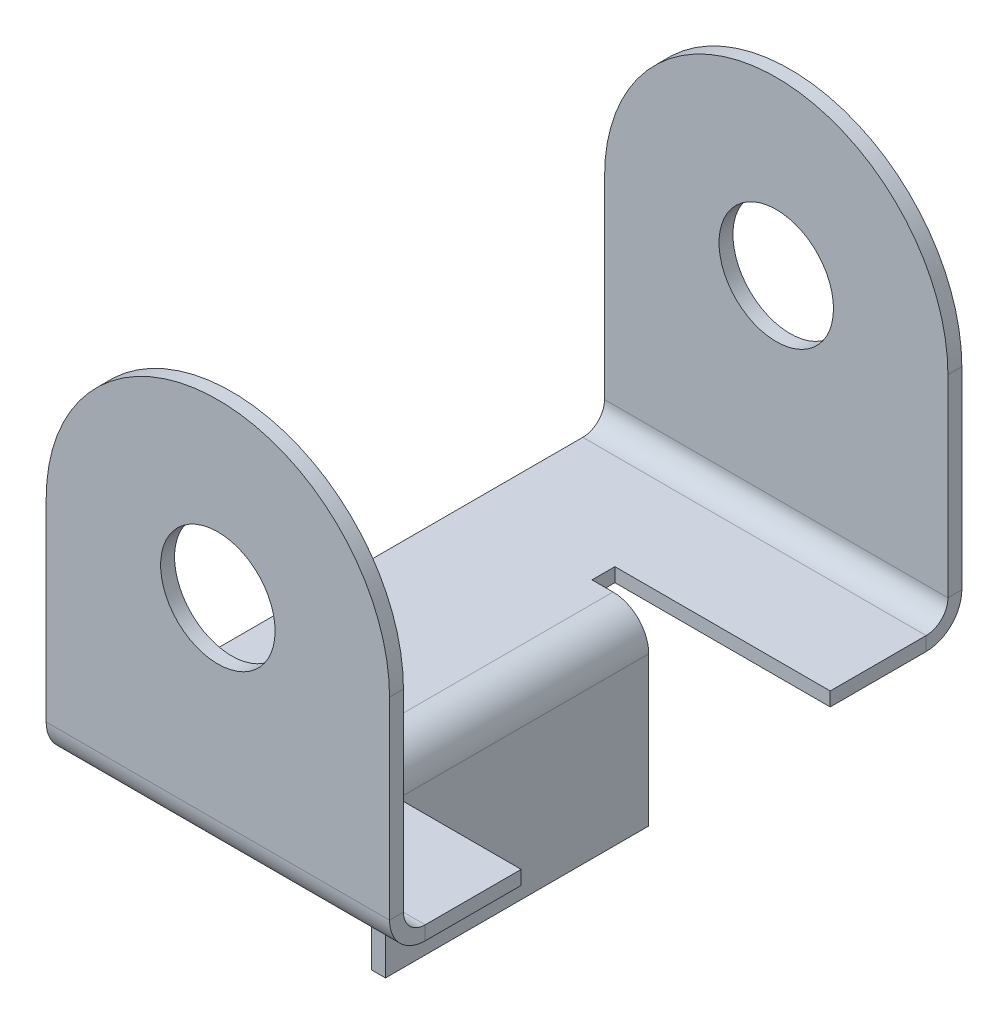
ISO-10303-21;
HEADER;
FILE_DESCRIPTION(('STEP AP214'),'2;1');
FILE_NAME('part.step','',(''),(''),'','','');
FILE_SCHEMA(('AUTOMOTIVE_DESIGN { 1 0 10303 214 1 1 1 1 }'));
ENDSEC;
DATA;
#1=APPLICATION_CONTEXT('core data for automotive mechanical design processes');
#2=APPLICATION_PROTOCOL_DEFINITION('international standard','automotive_design',2000,#1);
#3=PRODUCT_CONTEXT('',#1,'mechanical');
#4=PRODUCT('Part','Part','',(#3));
#5=PRODUCT_RELATED_PRODUCT_CATEGORY('part','',(#4));
#6=PRODUCT_DEFINITION_FORMATION('','',#4);
#7=PRODUCT_DEFINITION_CONTEXT('part definition',#1,'design');
#8=PRODUCT_DEFINITION('design','',#6,#7);
#9=PRODUCT_DEFINITION_SHAPE('','',#8);
#10=(LENGTH_UNIT() NAMED_UNIT(*) SI_UNIT(.MILLI.,.METRE.));
#11=(NAMED_UNIT(*) PLANE_ANGLE_UNIT() SI_UNIT($,.RADIAN.));
#12=(NAMED_UNIT(*) SI_UNIT($,.STERADIAN.) SOLID_ANGLE_UNIT());
#13=UNCERTAINTY_MEASURE_WITH_UNIT(LENGTH_MEASURE(1.E-05),#10,'distance_accuracy_value','');
#14=(GEOMETRIC_REPRESENTATION_CONTEXT(3) GLOBAL_UNCERTAINTY_ASSIGNED_CONTEXT((#13)) GLOBAL_UNIT_ASSIGNED_CONTEXT((#10,
#11,#12)) REPRESENTATION_CONTEXT('',''));
#15=CARTESIAN_POINT('',(0.,0.,0.));
#16=DIRECTION('',(0.,0.,1.));
#17=DIRECTION('',(1.,0.,0.));
#18=AXIS2_PLACEMENT_3D('',#15,#16,#17);
#19=CARTESIAN_POINT('',(18.81,-20.,-11.5));
#20=DIRECTION('',(0.,0.,-1.));
#21=DIRECTION('',(-1.,0.,0.));
#22=AXIS2_PLACEMENT_3D('',#19,#20,#21);
#23=PLANE('',#22);
#24=DIRECTION('',(-1.,0.,0.));
#25=VECTOR('',#24,1.);
#26=CARTESIAN_POINT('',(-15.,-18.78588,-11.5));
#27=LINE('',#26,#25);
#28=CARTESIAN_POINT('',(-3.81000000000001,-18.78588,-11.5));
#29=VERTEX_POINT('',#28);
#30=CARTESIAN_POINT('',(-1.9729673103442,-18.78588,-11.5));
#31=VERTEX_POINT('',#30);
#32=EDGE_CURVE('E216',#29,#31,#27,.F.);
#33=ORIENTED_EDGE('',*,*,#32,.T.);
#34=DIRECTION('',(0.,-1.,0.));
#35=VECTOR('',#34,1.);
#36=CARTESIAN_POINT('',(-1.97296731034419,-20.,-11.5));
#37=LINE('',#36,#35);
#38=CARTESIAN_POINT('',(-1.97296731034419,-20.,-11.5));
#39=VERTEX_POINT('',#38);
#40=EDGE_CURVE('E270',#31,#39,#37,.T.);
#41=ORIENTED_EDGE('',*,*,#40,.T.);
#42=DIRECTION('',(-1.,0.,0.));
#43=VECTOR('',#42,1.);
#44=CARTESIAN_POINT('',(18.81,-20.,-11.5));
#45=LINE('',#44,#43);
#46=CARTESIAN_POINT('',(-3.81000000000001,-20.,-11.5));
#47=VERTEX_POINT('',#46);
#48=EDGE_CURVE('E278',#47,#39,#45,.F.);
#49=ORIENTED_EDGE('',*,*,#48,.F.);
#50=DIRECTION('',(0.,-1.,0.));
#51=VECTOR('',#50,1.);
#52=CARTESIAN_POINT('',(-3.81000000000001,-20.,-11.5));
#53=LINE('',#52,#51);
#54=EDGE_CURVE('E256',#29,#47,#53,.T.);
#55=ORIENTED_EDGE('',*,*,#54,.F.);
#56=EDGE_LOOP('',(#33,#41,#49,#55));
#57=FACE_BOUND('',#56,.T.);
#58=ADVANCED_FACE('F40',(#57),#23,.T.);
#59=CARTESIAN_POINT('',(18.81,-20.,11.5));
#60=DIRECTION('',(0.,0.,-1.));
#61=DIRECTION('',(-1.,0.,0.));
#62=AXIS2_PLACEMENT_3D('',#59,#60,#61);
#63=PLANE('',#62);
#64=DIRECTION('',(-1.,0.,0.));
#65=VECTOR('',#64,1.);
#66=CARTESIAN_POINT('',(18.81,-20.,11.5));
#67=LINE('',#66,#65);
#68=CARTESIAN_POINT('',(-1.97296731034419,-20.,11.5));
#69=VERTEX_POINT('',#68);
#70=CARTESIAN_POINT('',(-3.81000000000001,-20.,11.5));
#71=VERTEX_POINT('',#70);
#72=EDGE_CURVE('E281',#69,#71,#67,.T.);
#73=ORIENTED_EDGE('',*,*,#72,.F.);
#74=DIRECTION('',(0.,1.,0.));
#75=VECTOR('',#74,1.);
#76=CARTESIAN_POINT('',(-1.97296731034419,-20.,11.5));
#77=LINE('',#76,#75);
#78=CARTESIAN_POINT('',(-1.97296731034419,-18.78588,11.5));
#79=VERTEX_POINT('',#78);
#80=EDGE_CURVE('E12',#69,#79,#77,.T.);
#81=ORIENTED_EDGE('',*,*,#80,.T.);
#82=DIRECTION('',(-1.,0.,0.));
#83=VECTOR('',#82,1.);
#84=CARTESIAN_POINT('',(-15.,-18.78588,11.5));
#85=LINE('',#84,#83);
#86=CARTESIAN_POINT('',(-3.81000000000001,-18.78588,11.5));
#87=VERTEX_POINT('',#86);
#88=EDGE_CURVE('E211',#79,#87,#85,.T.);
#89=ORIENTED_EDGE('',*,*,#88,.T.);
#90=DIRECTION('',(0.,-1.,0.));
#91=VECTOR('',#90,1.);
#92=CARTESIAN_POINT('',(-3.81000000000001,-20.,11.5));
#93=LINE('',#92,#91);
#94=EDGE_CURVE('E253',#87,#71,#93,.T.);
#95=ORIENTED_EDGE('',*,*,#94,.T.);
#96=EDGE_LOOP('',(#73,#81,#89,#95));
#97=FACE_BOUND('',#96,.T.);
#98=ADVANCED_FACE('F42',(#97),#63,.F.);
#99=CARTESIAN_POINT('',(-15.,-18.78588,25.));
#100=DIRECTION('',(0.,1.,0.));
#101=DIRECTION('',(-1.,0.,0.));
#102=AXIS2_PLACEMENT_3D('',#99,#100,#101);
#103=PLANE('',#102);
#104=ORIENTED_EDGE('',*,*,#88,.F.);
#105=DIRECTION('',(0.,0.,-1.));
#106=VECTOR('',#105,1.);
#107=CARTESIAN_POINT('',(-1.97296731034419,-18.78588,25.));
#108=LINE('',#107,#106);
#109=EDGE_CURVE('E49',#79,#31,#108,.T.);
#110=ORIENTED_EDGE('',*,*,#109,.T.);
#111=ORIENTED_EDGE('',*,*,#32,.F.);
#112=DIRECTION('',(0.,0.,1.));
#113=VECTOR('',#112,1.);
#114=CARTESIAN_POINT('',(-3.81000000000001,-18.78588,25.));
#115=LINE('',#114,#113);
#116=CARTESIAN_POINT('',(-3.81000000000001,-18.78588,-13.5));
#117=VERTEX_POINT('',#116);
#118=EDGE_CURVE('E212',#117,#29,#115,.T.);
#119=ORIENTED_EDGE('',*,*,#118,.F.);
#120=DIRECTION('',(-1.,0.,0.));
#121=VECTOR('',#120,1.);
#122=CARTESIAN_POINT('',(-15.,-18.78588,-13.5));
#123=LINE('',#122,#121);
#124=CARTESIAN_POINT('',(15.,-18.78588,-13.5));
#125=VERTEX_POINT('',#124);
#126=EDGE_CURVE('E215',#125,#117,#123,.T.);
#127=ORIENTED_EDGE('',*,*,#126,.F.);
#128=DIRECTION('',(0.,0.,1.));
#129=VECTOR('',#128,1.);
#130=CARTESIAN_POINT('',(15.,-18.78588,25.));
#131=LINE('',#130,#129);
#132=CARTESIAN_POINT('',(15.,-18.78588,-21.88088));
#133=VERTEX_POINT('',#132);
#134=EDGE_CURVE('E200',#125,#133,#131,.F.);
#135=ORIENTED_EDGE('',*,*,#134,.T.);
#136=DIRECTION('',(-1.,0.,0.));
#137=VECTOR('',#136,1.);
#138=CARTESIAN_POINT('',(-15.,-18.78588,-21.88088));
#139=LINE('',#138,#137);
#140=CARTESIAN_POINT('',(-15.,-18.78588,-21.88088));
#141=VERTEX_POINT('',#140);
#142=EDGE_CURVE('E162',#141,#133,#139,.F.);
#143=ORIENTED_EDGE('',*,*,#142,.F.);
#144=DIRECTION('',(0.,0.,1.));
#145=VECTOR('',#144,1.);
#146=CARTESIAN_POINT('',(-15.,-18.78588,25.));
#147=LINE('',#146,#145);
#148=CARTESIAN_POINT('',(-15.,-18.78588,21.88088));
#149=VERTEX_POINT('',#148);
#150=EDGE_CURVE('E184',#149,#141,#147,.F.);
#151=ORIENTED_EDGE('',*,*,#150,.F.);
#152=DIRECTION('',(-1.,0.,0.));
#153=VECTOR('',#152,1.);
#154=CARTESIAN_POINT('',(-15.,-18.78588,21.88088));
#155=LINE('',#154,#153);
#156=CARTESIAN_POINT('',(15.,-18.78588,21.88088));
#157=VERTEX_POINT('',#156);
#158=EDGE_CURVE('E324',#157,#149,#155,.T.);
#159=ORIENTED_EDGE('',*,*,#158,.F.);
#160=DIRECTION('',(0.,0.,1.));
#161=VECTOR('',#160,1.);
#162=CARTESIAN_POINT('',(15.,-18.78588,25.));
#163=LINE('',#162,#161);
#164=CARTESIAN_POINT('',(15.,-18.78588,13.5));
#165=VERTEX_POINT('',#164);
#166=EDGE_CURVE('E187',#157,#165,#163,.F.);
#167=ORIENTED_EDGE('',*,*,#166,.T.);
#168=DIRECTION('',(-1.,0.,0.));
#169=VECTOR('',#168,1.);
#170=CARTESIAN_POINT('',(-15.,-18.78588,13.5));
#171=LINE('',#170,#169);
#172=CARTESIAN_POINT('',(-3.81000000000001,-18.78588,13.5));
#173=VERTEX_POINT('',#172);
#174=EDGE_CURVE('E175',#173,#165,#171,.F.);
#175=ORIENTED_EDGE('',*,*,#174,.F.);
#176=DIRECTION('',(0.,0.,1.));
#177=VECTOR('',#176,1.);
#178=CARTESIAN_POINT('',(-3.81000000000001,-18.78588,25.));
#179=LINE('',#178,#177);
#180=EDGE_CURVE('E208',#87,#173,#179,.T.);
#181=ORIENTED_EDGE('',*,*,#180,.F.);
#182=EDGE_LOOP('',(#104,#110,#111,#119,#127,#135,#143,#151,#159,#167,#175,#181));
#183=FACE_BOUND('',#182,.T.);
#184=ADVANCED_FACE('F349',(#183),#103,.T.);
#185=CARTESIAN_POINT('',(15.,-20.,25.));
#186=DIRECTION('',(1.,0.,0.));
#187=DIRECTION('',(0.,0.,-1.));
#188=AXIS2_PLACEMENT_3D('',#185,#186,#187);
#189=PLANE('',#188);
#190=DIRECTION('',(0.,-1.,0.));
#191=VECTOR('',#190,1.);
#192=CARTESIAN_POINT('',(15.,-20.,-21.88088));
#193=LINE('',#192,#191);
#194=CARTESIAN_POINT('',(15.,-20.,-21.88088));
#195=VERTEX_POINT('',#194);
#196=EDGE_CURVE('E265',#133,#195,#193,.T.);
#197=ORIENTED_EDGE('',*,*,#196,.F.);
#198=ORIENTED_EDGE('',*,*,#134,.F.);
#199=DIRECTION('',(0.,-1.,0.));
#200=VECTOR('',#199,1.);
#201=CARTESIAN_POINT('',(15.,-20.,-13.5));
#202=LINE('',#201,#200);
#203=CARTESIAN_POINT('',(15.,-20.,-13.5));
#204=VERTEX_POINT('',#203);
#205=EDGE_CURVE('E262',#125,#204,#202,.T.);
#206=ORIENTED_EDGE('',*,*,#205,.T.);
#207=DIRECTION('',(0.,0.,-1.));
#208=VECTOR('',#207,1.);
#209=CARTESIAN_POINT('',(15.,-20.,25.));
#210=LINE('',#209,#208);
#211=EDGE_CURVE('E372',#204,#195,#210,.T.);
#212=ORIENTED_EDGE('',*,*,#211,.T.);
#213=EDGE_LOOP('',(#197,#198,#206,#212));
#214=FACE_BOUND('',#213,.T.);
#215=ADVANCED_FACE('F531',(#214),#189,.T.);
#216=CARTESIAN_POINT('',(18.81,-20.,-13.5));
#217=DIRECTION('',(0.,0.,-1.));
#218=DIRECTION('',(-1.,0.,0.));
#219=AXIS2_PLACEMENT_3D('',#216,#217,#218);
#220=PLANE('',#219);
#221=ORIENTED_EDGE('',*,*,#205,.F.);
#222=ORIENTED_EDGE('',*,*,#126,.T.);
#223=DIRECTION('',(0.,-1.,0.));
#224=VECTOR('',#223,1.);
#225=CARTESIAN_POINT('',(-3.81000000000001,-20.,-13.5));
#226=LINE('',#225,#224);
#227=CARTESIAN_POINT('',(-3.81000000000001,-20.,-13.5));
#228=VERTEX_POINT('',#227);
#229=EDGE_CURVE('E259',#117,#228,#226,.T.);
#230=ORIENTED_EDGE('',*,*,#229,.T.);
#231=DIRECTION('',(-1.,0.,0.));
#232=VECTOR('',#231,1.);
#233=CARTESIAN_POINT('',(18.81,-20.,-13.5));
#234=LINE('',#233,#232);
#235=EDGE_CURVE('E301',#204,#228,#234,.T.);
#236=ORIENTED_EDGE('',*,*,#235,.F.);
#237=EDGE_LOOP('',(#221,#222,#230,#236));
#238=FACE_BOUND('',#237,.T.);
#239=ADVANCED_FACE('F535',(#238),#220,.F.);
#240=CARTESIAN_POINT('',(-3.81000000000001,-20.,25.));
#241=DIRECTION('',(-1.,0.,0.));
#242=DIRECTION('',(0.,0.,1.));
#243=AXIS2_PLACEMENT_3D('',#240,#241,#242);
#244=PLANE('',#243);
#245=ORIENTED_EDGE('',*,*,#229,.F.);
#246=ORIENTED_EDGE('',*,*,#118,.T.);
#247=ORIENTED_EDGE('',*,*,#54,.T.);
#248=DIRECTION('',(0.,0.,1.));
#249=VECTOR('',#248,1.);
#250=CARTESIAN_POINT('',(-3.81000000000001,-20.,25.));
#251=LINE('',#250,#249);
#252=EDGE_CURVE('E280',#228,#47,#251,.T.);
#253=ORIENTED_EDGE('',*,*,#252,.F.);
#254=EDGE_LOOP('',(#245,#246,#247,#253));
#255=FACE_BOUND('',#254,.T.);
#256=ADVANCED_FACE('F541',(#255),#244,.F.);
#257=CARTESIAN_POINT('',(-3.81000000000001,-20.,25.));
#258=DIRECTION('',(-1.,0.,0.));
#259=DIRECTION('',(0.,0.,1.));
#260=AXIS2_PLACEMENT_3D('',#257,#258,#259);
#261=PLANE('',#260);
#262=ORIENTED_EDGE('',*,*,#94,.F.);
#263=ORIENTED_EDGE('',*,*,#180,.T.);
#264=DIRECTION('',(0.,-1.,0.));
#265=VECTOR('',#264,1.);
#266=CARTESIAN_POINT('',(-3.81000000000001,-20.,13.5));
#267=LINE('',#266,#265);
#268=CARTESIAN_POINT('',(-3.81000000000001,-20.,13.5));
#269=VERTEX_POINT('',#268);
#270=EDGE_CURVE('E250',#173,#269,#267,.T.);
#271=ORIENTED_EDGE('',*,*,#270,.T.);
#272=DIRECTION('',(0.,0.,1.));
#273=VECTOR('',#272,1.);
#274=CARTESIAN_POINT('',(-3.81000000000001,-20.,25.));
#275=LINE('',#274,#273);
#276=EDGE_CURVE('E283',#71,#269,#275,.T.);
#277=ORIENTED_EDGE('',*,*,#276,.F.);
#278=EDGE_LOOP('',(#262,#263,#271,#277));
#279=FACE_BOUND('',#278,.T.);
#280=ADVANCED_FACE('F553',(#279),#261,.F.);
#281=CARTESIAN_POINT('',(18.81,-20.,13.5));
#282=DIRECTION('',(0.,0.,-1.));
#283=DIRECTION('',(-1.,0.,0.));
#284=AXIS2_PLACEMENT_3D('',#281,#282,#283);
#285=PLANE('',#284);
#286=ORIENTED_EDGE('',*,*,#270,.F.);
#287=ORIENTED_EDGE('',*,*,#174,.T.);
#288=DIRECTION('',(0.,-1.,0.));
#289=VECTOR('',#288,1.);
#290=CARTESIAN_POINT('',(15.,-20.,13.5));
#291=LINE('',#290,#289);
#292=CARTESIAN_POINT('',(15.,-20.,13.5));
#293=VERTEX_POINT('',#292);
#294=EDGE_CURVE('E247',#165,#293,#291,.T.);
#295=ORIENTED_EDGE('',*,*,#294,.T.);
#296=DIRECTION('',(-1.,0.,0.));
#297=VECTOR('',#296,1.);
#298=CARTESIAN_POINT('',(18.81,-20.,13.5));
#299=LINE('',#298,#297);
#300=EDGE_CURVE('E289',#269,#293,#299,.F.);
#301=ORIENTED_EDGE('',*,*,#300,.F.);
#302=EDGE_LOOP('',(#286,#287,#295,#301));
#303=FACE_BOUND('',#302,.T.);
#304=ADVANCED_FACE('F546',(#303),#285,.T.);
#305=ORIENTED_EDGE('',*,*,#294,.F.);
#306=ORIENTED_EDGE('',*,*,#166,.F.);
#307=DIRECTION('',(0.,-1.,0.));
#308=VECTOR('',#307,1.);
#309=CARTESIAN_POINT('',(15.,-20.,21.88088));
#310=LINE('',#309,#308);
#311=CARTESIAN_POINT('',(15.,-20.,21.88088));
#312=VERTEX_POINT('',#311);
#313=EDGE_CURVE('E66',#157,#312,#310,.T.);
#314=ORIENTED_EDGE('',*,*,#313,.T.);
#315=EDGE_CURVE('E44',#312,#293,#210,.T.);
#316=ORIENTED_EDGE('',*,*,#315,.T.);
#317=EDGE_LOOP('',(#305,#306,#314,#316));
#318=FACE_BOUND('',#317,.T.);
#319=ADVANCED_FACE('F537',(#318),#189,.T.);
#320=CARTESIAN_POINT('',(15.,-16.88088,21.88088));
#321=DIRECTION('',(1.,0.,0.));
#322=DIRECTION('',(0.,1.,0.));
#323=AXIS2_PLACEMENT_3D('',#320,#321,#322);
#324=PLANE('',#323);
#325=ORIENTED_EDGE('',*,*,#313,.F.);
#326=CARTESIAN_POINT('',(15.,-16.88088,21.88088));
#327=DIRECTION('',(-1.,0.,0.));
#328=DIRECTION('',(0.,-1.,0.));
#329=AXIS2_PLACEMENT_3D('',#326,#327,#328);
#330=CIRCLE('',#329,1.905);
#331=CARTESIAN_POINT('',(15.,-16.88088,23.78588));
#332=VERTEX_POINT('',#331);
#333=EDGE_CURVE('E190',#157,#332,#330,.T.);
#334=ORIENTED_EDGE('',*,*,#333,.T.);
#335=DIRECTION('',(0.,0.,1.));
#336=VECTOR('',#335,1.);
#337=CARTESIAN_POINT('',(15.,-16.88088,25.));
#338=LINE('',#337,#336);
#339=CARTESIAN_POINT('',(15.,-16.88088,25.));
#340=VERTEX_POINT('',#339);
#341=EDGE_CURVE('E243',#332,#340,#338,.T.);
#342=ORIENTED_EDGE('',*,*,#341,.T.);
#343=CARTESIAN_POINT('',(15.,-16.88088,21.88088));
#344=DIRECTION('',(-1.,0.,0.));
#345=DIRECTION('',(0.,-1.,0.));
#346=AXIS2_PLACEMENT_3D('',#343,#344,#345);
#347=CIRCLE('',#346,3.11912);
#348=EDGE_CURVE('E321',#312,#340,#347,.T.);
#349=ORIENTED_EDGE('',*,*,#348,.F.);
#350=EDGE_LOOP('',(#325,#334,#342,#349));
#351=FACE_BOUND('',#350,.T.);
#352=ADVANCED_FACE('F342',(#351),#324,.T.);
#353=CARTESIAN_POINT('',(15.,0.,25.));
#354=DIRECTION('',(1.,0.,0.));
#355=DIRECTION('',(0.,1.,0.));
#356=AXIS2_PLACEMENT_3D('',#353,#354,#355);
#357=PLANE('',#356);
#358=ORIENTED_EDGE('',*,*,#341,.F.);
#359=DIRECTION('',(0.,1.,0.));
#360=VECTOR('',#359,1.);
#361=CARTESIAN_POINT('',(15.,0.,23.78588));
#362=LINE('',#361,#360);
#363=CARTESIAN_POINT('',(15.,0.,23.78588));
#364=VERTEX_POINT('',#363);
#365=EDGE_CURVE('E194',#332,#364,#362,.T.);
#366=ORIENTED_EDGE('',*,*,#365,.T.);
#367=DIRECTION('',(0.,0.,1.));
#368=VECTOR('',#367,1.);
#369=CARTESIAN_POINT('',(15.,0.,25.));
#370=LINE('',#369,#368);
#371=CARTESIAN_POINT('',(15.,0.,25.));
#372=VERTEX_POINT('',#371);
#373=EDGE_CURVE('E240',#364,#372,#370,.T.);
#374=ORIENTED_EDGE('',*,*,#373,.T.);
#375=DIRECTION('',(0.,1.,0.));
#376=VECTOR('',#375,1.);
#377=CARTESIAN_POINT('',(15.,0.,25.));
#378=LINE('',#377,#376);
#379=EDGE_CURVE('E370',#340,#372,#378,.T.);
#380=ORIENTED_EDGE('',*,*,#379,.F.);
#381=EDGE_LOOP('',(#358,#366,#374,#380));
#382=FACE_BOUND('',#381,.T.);
#383=ADVANCED_FACE('F551',(#382),#357,.T.);
#384=CARTESIAN_POINT('',(0.,0.,25.));
#385=DIRECTION('',(0.,0.,1.));
#386=DIRECTION('',(1.,0.,0.));
#387=AXIS2_PLACEMENT_3D('',#384,#385,#386);
#388=CYLINDRICAL_SURFACE('',#387,15.);
#389=ORIENTED_EDGE('',*,*,#373,.F.);
#390=CARTESIAN_POINT('',(0.,0.,23.78588));
#391=DIRECTION('',(0.,0.,1.));
#392=DIRECTION('',(1.,0.,0.));
#393=AXIS2_PLACEMENT_3D('',#390,#391,#392);
#394=CIRCLE('',#393,15.);
#395=CARTESIAN_POINT('',(-15.,0.,23.78588));
#396=VERTEX_POINT('',#395);
#397=EDGE_CURVE('E195',#364,#396,#394,.T.);
#398=ORIENTED_EDGE('',*,*,#397,.T.);
#399=DIRECTION('',(0.,0.,1.));
#400=VECTOR('',#399,1.);
#401=CARTESIAN_POINT('',(-15.,0.,25.));
#402=LINE('',#401,#400);
#403=CARTESIAN_POINT('',(-15.,0.,25.));
#404=VERTEX_POINT('',#403);
#405=EDGE_CURVE('E237',#396,#404,#402,.T.);
#406=ORIENTED_EDGE('',*,*,#405,.T.);
#407=CARTESIAN_POINT('',(0.,0.,25.));
#408=DIRECTION('',(0.,0.,1.));
#409=DIRECTION('',(1.,0.,0.));
#410=AXIS2_PLACEMENT_3D('',#407,#408,#409);
#411=CIRCLE('',#410,15.);
#412=EDGE_CURVE('E369',#372,#404,#411,.T.);
#413=ORIENTED_EDGE('',*,*,#412,.F.);
#414=EDGE_LOOP('',(#389,#398,#406,#413));
#415=FACE_BOUND('',#414,.T.);
#416=ADVANCED_FACE('F575',(#415),#388,.T.);
#417=CARTESIAN_POINT('',(-15.,0.,25.));
#418=DIRECTION('',(-1.,0.,0.));
#419=DIRECTION('',(0.,-1.,0.));
#420=AXIS2_PLACEMENT_3D('',#417,#418,#419);
#421=PLANE('',#420);
#422=ORIENTED_EDGE('',*,*,#405,.F.);
#423=DIRECTION('',(0.,1.,0.));
#424=VECTOR('',#423,1.);
#425=CARTESIAN_POINT('',(-15.,0.,23.78588));
#426=LINE('',#425,#424);
#427=CARTESIAN_POINT('',(-15.,-16.88088,23.78588));
#428=VERTEX_POINT('',#427);
#429=EDGE_CURVE('E191',#396,#428,#426,.F.);
#430=ORIENTED_EDGE('',*,*,#429,.T.);
#431=DIRECTION('',(0.,0.,1.));
#432=VECTOR('',#431,1.);
#433=CARTESIAN_POINT('',(-15.,-16.88088,25.));
#434=LINE('',#433,#432);
#435=CARTESIAN_POINT('',(-15.,-16.88088,25.));
#436=VERTEX_POINT('',#435);
#437=EDGE_CURVE('E234',#428,#436,#434,.T.);
#438=ORIENTED_EDGE('',*,*,#437,.T.);
#439=DIRECTION('',(0.,-1.,0.));
#440=VECTOR('',#439,1.);
#441=CARTESIAN_POINT('',(-15.,0.,25.));
#442=LINE('',#441,#440);
#443=EDGE_CURVE('E361',#404,#436,#442,.T.);
#444=ORIENTED_EDGE('',*,*,#443,.F.);
#445=EDGE_LOOP('',(#422,#430,#438,#444));
#446=FACE_BOUND('',#445,.T.);
#447=ADVANCED_FACE('F360',(#446),#421,.T.);
#448=CARTESIAN_POINT('',(-15.,-16.88088,21.88088));
#449=DIRECTION('',(1.,0.,0.));
#450=DIRECTION('',(0.,1.,0.));
#451=AXIS2_PLACEMENT_3D('',#448,#449,#450);
#452=PLANE('',#451);
#453=ORIENTED_EDGE('',*,*,#437,.F.);
#454=CARTESIAN_POINT('',(-15.,-16.88088,21.88088));
#455=DIRECTION('',(-1.,0.,0.));
#456=DIRECTION('',(0.,-1.,0.));
#457=AXIS2_PLACEMENT_3D('',#454,#455,#456);
#458=CIRCLE('',#457,1.905);
#459=EDGE_CURVE('E169',#428,#149,#458,.F.);
#460=ORIENTED_EDGE('',*,*,#459,.T.);
#461=DIRECTION('',(0.,-1.,0.));
#462=VECTOR('',#461,1.);
#463=CARTESIAN_POINT('',(-15.,-20.,21.88088));
#464=LINE('',#463,#462);
#465=CARTESIAN_POINT('',(-15.,-20.,21.88088));
#466=VERTEX_POINT('',#465);
#467=EDGE_CURVE('E232',#149,#466,#464,.T.);
#468=ORIENTED_EDGE('',*,*,#467,.T.);
#469=CARTESIAN_POINT('',(-15.,-16.88088,21.88088));
#470=DIRECTION('',(-1.,0.,0.));
#471=DIRECTION('',(0.,-1.,0.));
#472=AXIS2_PLACEMENT_3D('',#469,#470,#471);
#473=CIRCLE('',#472,3.11912);
#474=EDGE_CURVE('E313',#436,#466,#473,.F.);
#475=ORIENTED_EDGE('',*,*,#474,.F.);
#476=EDGE_LOOP('',(#453,#460,#468,#475));
#477=FACE_BOUND('',#476,.T.);
#478=ADVANCED_FACE('F353',(#477),#452,.F.);
#479=CARTESIAN_POINT('',(-15.,-20.,25.));
#480=DIRECTION('',(1.,0.,0.));
#481=DIRECTION('',(0.,0.,-1.));
#482=AXIS2_PLACEMENT_3D('',#479,#480,#481);
#483=PLANE('',#482);
#484=ORIENTED_EDGE('',*,*,#467,.F.);
#485=ORIENTED_EDGE('',*,*,#150,.T.);
#486=DIRECTION('',(0.,-1.,0.));
#487=VECTOR('',#486,1.);
#488=CARTESIAN_POINT('',(-15.,-20.,-21.88088));
#489=LINE('',#488,#487);
#490=CARTESIAN_POINT('',(-15.,-20.,-21.88088));
#491=VERTEX_POINT('',#490);
#492=EDGE_CURVE('E229',#141,#491,#489,.T.);
#493=ORIENTED_EDGE('',*,*,#492,.T.);
#494=DIRECTION('',(0.,0.,-1.));
#495=VECTOR('',#494,1.);
#496=CARTESIAN_POINT('',(-15.,-20.,25.));
#497=LINE('',#496,#495);
#498=EDGE_CURVE('E377',#466,#491,#497,.T.);
#499=ORIENTED_EDGE('',*,*,#498,.F.);
#500=EDGE_LOOP('',(#484,#485,#493,#499));
#501=FACE_BOUND('',#500,.T.);
#502=ADVANCED_FACE('F562',(#501),#483,.F.);
#503=CARTESIAN_POINT('',(-15.,-16.88088,-21.88088));
#504=DIRECTION('',(-1.,0.,0.));
#505=DIRECTION('',(0.,-1.,0.));
#506=AXIS2_PLACEMENT_3D('',#503,#504,#505);
#507=PLANE('',#506);
#508=ORIENTED_EDGE('',*,*,#492,.F.);
#509=CARTESIAN_POINT('',(-15.,-16.88088,-21.88088));
#510=DIRECTION('',(1.,0.,0.));
#511=DIRECTION('',(0.,1.,0.));
#512=AXIS2_PLACEMENT_3D('',#509,#510,#511);
#513=CIRCLE('',#512,1.905);
#514=CARTESIAN_POINT('',(-15.,-16.88088,-23.78588));
#515=VERTEX_POINT('',#514);
#516=EDGE_CURVE('E168',#141,#515,#513,.T.);
#517=ORIENTED_EDGE('',*,*,#516,.T.);
#518=DIRECTION('',(0.,0.,-1.));
#519=VECTOR('',#518,1.);
#520=CARTESIAN_POINT('',(-15.,-16.88088,-25.));
#521=LINE('',#520,#519);
#522=CARTESIAN_POINT('',(-15.,-16.88088,-25.));
#523=VERTEX_POINT('',#522);
#524=EDGE_CURVE('E226',#515,#523,#521,.T.);
#525=ORIENTED_EDGE('',*,*,#524,.T.);
#526=CARTESIAN_POINT('',(-15.,-16.88088,-21.88088));
#527=DIRECTION('',(1.,0.,0.));
#528=DIRECTION('',(0.,1.,0.));
#529=AXIS2_PLACEMENT_3D('',#526,#527,#528);
#530=CIRCLE('',#529,3.11912);
#531=EDGE_CURVE('E312',#491,#523,#530,.T.);
#532=ORIENTED_EDGE('',*,*,#531,.F.);
#533=EDGE_LOOP('',(#508,#517,#525,#532));
#534=FACE_BOUND('',#533,.T.);
#535=ADVANCED_FACE('F561',(#534),#507,.T.);
#536=CARTESIAN_POINT('',(-15.,0.,-25.));
#537=DIRECTION('',(-1.,0.,0.));
#538=DIRECTION('',(0.,-1.,0.));
#539=AXIS2_PLACEMENT_3D('',#536,#537,#538);
#540=PLANE('',#539);
#541=ORIENTED_EDGE('',*,*,#524,.F.);
#542=DIRECTION('',(0.,1.,0.));
#543=VECTOR('',#542,1.);
#544=CARTESIAN_POINT('',(-15.,0.,-23.78588));
#545=LINE('',#544,#543);
#546=CARTESIAN_POINT('',(-15.,0.,-23.78588));
#547=VERTEX_POINT('',#546);
#548=EDGE_CURVE('E157',#547,#515,#545,.F.);
#549=ORIENTED_EDGE('',*,*,#548,.F.);
#550=DIRECTION('',(0.,0.,-1.));
#551=VECTOR('',#550,1.);
#552=CARTESIAN_POINT('',(-15.,0.,-25.));
#553=LINE('',#552,#551);
#554=CARTESIAN_POINT('',(-15.,0.,-25.));
#555=VERTEX_POINT('',#554);
#556=EDGE_CURVE('E223',#547,#555,#553,.T.);
#557=ORIENTED_EDGE('',*,*,#556,.T.);
#558=DIRECTION('',(0.,-1.,0.));
#559=VECTOR('',#558,1.);
#560=CARTESIAN_POINT('',(-15.,0.,-25.));
#561=LINE('',#560,#559);
#562=EDGE_CURVE('E295',#555,#523,#561,.T.);
#563=ORIENTED_EDGE('',*,*,#562,.T.);
#564=EDGE_LOOP('',(#541,#549,#557,#563));
#565=FACE_BOUND('',#564,.T.);
#566=ADVANCED_FACE('F390',(#565),#540,.T.);
#567=CARTESIAN_POINT('',(0.,0.,-25.));
#568=DIRECTION('',(0.,0.,1.));
#569=DIRECTION('',(1.,0.,0.));
#570=AXIS2_PLACEMENT_3D('',#567,#568,#569);
#571=CYLINDRICAL_SURFACE('',#570,15.);
#572=ORIENTED_EDGE('',*,*,#556,.F.);
#573=CARTESIAN_POINT('',(0.,0.,-23.78588));
#574=DIRECTION('',(0.,0.,1.));
#575=DIRECTION('',(1.,0.,0.));
#576=AXIS2_PLACEMENT_3D('',#573,#574,#575);
#577=CIRCLE('',#576,15.);
#578=CARTESIAN_POINT('',(15.,0.,-23.78588));
#579=VERTEX_POINT('',#578);
#580=EDGE_CURVE('E173',#579,#547,#577,.T.);
#581=ORIENTED_EDGE('',*,*,#580,.F.);
#582=DIRECTION('',(0.,0.,-1.));
#583=VECTOR('',#582,1.);
#584=CARTESIAN_POINT('',(15.,0.,-25.));
#585=LINE('',#584,#583);
#586=CARTESIAN_POINT('',(15.,0.,-25.));
#587=VERTEX_POINT('',#586);
#588=EDGE_CURVE('E144',#579,#587,#585,.T.);
#589=ORIENTED_EDGE('',*,*,#588,.T.);
#590=CARTESIAN_POINT('',(0.,0.,-25.));
#591=DIRECTION('',(0.,0.,1.));
#592=DIRECTION('',(1.,0.,0.));
#593=AXIS2_PLACEMENT_3D('',#590,#591,#592);
#594=CIRCLE('',#593,15.);
#595=EDGE_CURVE('E383',#587,#555,#594,.T.);
#596=ORIENTED_EDGE('',*,*,#595,.T.);
#597=EDGE_LOOP('',(#572,#581,#589,#596));
#598=FACE_BOUND('',#597,.T.);
#599=ADVANCED_FACE('F596',(#598),#571,.T.);
#600=CARTESIAN_POINT('',(15.,0.,-25.));
#601=DIRECTION('',(1.,0.,0.));
#602=DIRECTION('',(0.,1.,0.));
#603=AXIS2_PLACEMENT_3D('',#600,#601,#602);
#604=PLANE('',#603);
#605=ORIENTED_EDGE('',*,*,#588,.F.);
#606=DIRECTION('',(0.,1.,0.));
#607=VECTOR('',#606,1.);
#608=CARTESIAN_POINT('',(15.,0.,-23.78588));
#609=LINE('',#608,#607);
#610=CARTESIAN_POINT('',(15.,-16.88088,-23.78588));
#611=VERTEX_POINT('',#610);
#612=EDGE_CURVE('E154',#611,#579,#609,.T.);
#613=ORIENTED_EDGE('',*,*,#612,.F.);
#614=DIRECTION('',(0.,0.,-1.));
#615=VECTOR('',#614,1.);
#616=CARTESIAN_POINT('',(15.,-16.88088,-25.));
#617=LINE('',#616,#615);
#618=CARTESIAN_POINT('',(15.,-16.88088,-25.));
#619=VERTEX_POINT('',#618);
#620=EDGE_CURVE('E130',#611,#619,#617,.T.);
#621=ORIENTED_EDGE('',*,*,#620,.T.);
#622=DIRECTION('',(0.,1.,0.));
#623=VECTOR('',#622,1.);
#624=CARTESIAN_POINT('',(15.,0.,-25.));
#625=LINE('',#624,#623);
#626=EDGE_CURVE('E386',#619,#587,#625,.T.);
#627=ORIENTED_EDGE('',*,*,#626,.T.);
#628=EDGE_LOOP('',(#605,#613,#621,#627));
#629=FACE_BOUND('',#628,.T.);
#630=ADVANCED_FACE('F171',(#629),#604,.T.);
#631=CARTESIAN_POINT('',(0.,0.,25.));
#632=DIRECTION('',(0.,0.,1.));
#633=DIRECTION('',(1.,0.,0.));
#634=AXIS2_PLACEMENT_3D('',#631,#632,#633);
#635=CYLINDRICAL_SURFACE('',#634,5.);
#636=CARTESIAN_POINT('',(0.,0.,25.));
#637=DIRECTION('',(0.,0.,1.));
#638=DIRECTION('',(1.,0.,0.));
#639=AXIS2_PLACEMENT_3D('',#636,#637,#638);
#640=CIRCLE('',#639,5.);
#641=CARTESIAN_POINT('',(5.,0.,25.));
#642=VERTEX_POINT('',#641);
#643=EDGE_CURVE('E316',#642,#642,#640,.T.);
#644=ORIENTED_EDGE('',*,*,#643,.T.);
#645=EDGE_LOOP('',(#644));
#646=FACE_BOUND('',#645,.T.);
#647=CARTESIAN_POINT('',(0.,0.,23.78588));
#648=DIRECTION('',(0.,0.,1.));
#649=DIRECTION('',(1.,0.,0.));
#650=AXIS2_PLACEMENT_3D('',#647,#648,#649);
#651=CIRCLE('',#650,5.);
#652=CARTESIAN_POINT('',(5.,0.,23.78588));
#653=VERTEX_POINT('',#652);
#654=EDGE_CURVE('E183',#653,#653,#651,.T.);
#655=ORIENTED_EDGE('',*,*,#654,.F.);
#656=EDGE_LOOP('',(#655));
#657=FACE_BOUND('',#656,.T.);
#658=ADVANCED_FACE('F507',(#646,#657),#635,.F.);
#659=CARTESIAN_POINT('',(0.,0.,-25.));
#660=DIRECTION('',(0.,0.,1.));
#661=DIRECTION('',(1.,0.,0.));
#662=AXIS2_PLACEMENT_3D('',#659,#660,#661);
#663=CYLINDRICAL_SURFACE('',#662,5.);
#664=CARTESIAN_POINT('',(0.,0.,-25.));
#665=DIRECTION('',(0.,0.,1.));
#666=DIRECTION('',(1.,0.,0.));
#667=AXIS2_PLACEMENT_3D('',#664,#665,#666);
#668=CIRCLE('',#667,5.);
#669=CARTESIAN_POINT('',(5.,0.,-25.));
#670=VERTEX_POINT('',#669);
#671=EDGE_CURVE('E380',#670,#670,#668,.T.);
#672=ORIENTED_EDGE('',*,*,#671,.F.);
#673=EDGE_LOOP('',(#672));
#674=FACE_BOUND('',#673,.T.);
#675=CARTESIAN_POINT('',(0.,0.,-23.78588));
#676=DIRECTION('',(0.,0.,1.));
#677=DIRECTION('',(1.,0.,0.));
#678=AXIS2_PLACEMENT_3D('',#675,#676,#677);
#679=CIRCLE('',#678,5.);
#680=CARTESIAN_POINT('',(5.,0.,-23.78588));
#681=VERTEX_POINT('',#680);
#682=EDGE_CURVE('E177',#681,#681,#679,.T.);
#683=ORIENTED_EDGE('',*,*,#682,.T.);
#684=EDGE_LOOP('',(#683));
#685=FACE_BOUND('',#684,.T.);
#686=ADVANCED_FACE('F588',(#674,#685),#663,.F.);
#687=CARTESIAN_POINT('',(15.,-16.88088,-21.88088));
#688=DIRECTION('',(-1.,0.,0.));
#689=DIRECTION('',(0.,-1.,0.));
#690=AXIS2_PLACEMENT_3D('',#687,#688,#689);
#691=PLANE('',#690);
#692=CARTESIAN_POINT('',(15.,-16.88088,-21.88088));
#693=DIRECTION('',(1.,0.,0.));
#694=DIRECTION('',(0.,1.,0.));
#695=AXIS2_PLACEMENT_3D('',#692,#693,#694);
#696=CIRCLE('',#695,1.905);
#697=EDGE_CURVE('E135',#611,#133,#696,.F.);
#698=ORIENTED_EDGE('',*,*,#697,.T.);
#699=ORIENTED_EDGE('',*,*,#196,.T.);
#700=CARTESIAN_POINT('',(15.,-16.88088,-21.88088));
#701=DIRECTION('',(1.,0.,0.));
#702=DIRECTION('',(0.,1.,0.));
#703=AXIS2_PLACEMENT_3D('',#700,#701,#702);
#704=CIRCLE('',#703,3.11912);
#705=EDGE_CURVE('E138',#619,#195,#704,.F.);
#706=ORIENTED_EDGE('',*,*,#705,.F.);
#707=ORIENTED_EDGE('',*,*,#620,.F.);
#708=EDGE_LOOP('',(#698,#699,#706,#707));
#709=FACE_BOUND('',#708,.T.);
#710=ADVANCED_FACE('F132',(#709),#691,.F.);
#711=CARTESIAN_POINT('',(0.,0.,-25.));
#712=DIRECTION('',(0.,0.,1.));
#713=DIRECTION('',(1.,0.,0.));
#714=AXIS2_PLACEMENT_3D('',#711,#712,#713);
#715=PLANE('',#714);
#716=ORIENTED_EDGE('',*,*,#671,.T.);
#717=EDGE_LOOP('',(#716));
#718=FACE_BOUND('',#717,.T.);
#719=ORIENTED_EDGE('',*,*,#626,.F.);
#720=DIRECTION('',(1.,0.,0.));
#721=VECTOR('',#720,1.);
#722=CARTESIAN_POINT('',(0.,-16.88088,-25.));
#723=LINE('',#722,#721);
#724=EDGE_CURVE('E307',#619,#523,#723,.F.);
#725=ORIENTED_EDGE('',*,*,#724,.T.);
#726=ORIENTED_EDGE('',*,*,#562,.F.);
#727=ORIENTED_EDGE('',*,*,#595,.F.);
#728=EDGE_LOOP('',(#719,#725,#726,#727));
#729=FACE_BOUND('',#728,.T.);
#730=ADVANCED_FACE('F395',(#718,#729),#715,.F.);
#731=CARTESIAN_POINT('',(-15.,-20.,25.));
#732=DIRECTION('',(0.,1.,0.));
#733=DIRECTION('',(-1.,0.,0.));
#734=AXIS2_PLACEMENT_3D('',#731,#732,#733);
#735=PLANE('',#734);
#736=DIRECTION('',(0.,0.,-1.));
#737=VECTOR('',#736,1.);
#738=CARTESIAN_POINT('',(-1.97296731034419,-20.,25.));
#739=LINE('',#738,#737);
#740=EDGE_CURVE('E266',#69,#39,#739,.T.);
#741=ORIENTED_EDGE('',*,*,#740,.F.);
#742=ORIENTED_EDGE('',*,*,#72,.T.);
#743=ORIENTED_EDGE('',*,*,#276,.T.);
#744=ORIENTED_EDGE('',*,*,#300,.T.);
#745=ORIENTED_EDGE('',*,*,#315,.F.);
#746=DIRECTION('',(1.,0.,0.));
#747=VECTOR('',#746,1.);
#748=CARTESIAN_POINT('',(-15.,-20.,21.88088));
#749=LINE('',#748,#747);
#750=EDGE_CURVE('E145',#312,#466,#749,.F.);
#751=ORIENTED_EDGE('',*,*,#750,.T.);
#752=ORIENTED_EDGE('',*,*,#498,.T.);
#753=DIRECTION('',(1.,0.,0.));
#754=VECTOR('',#753,1.);
#755=CARTESIAN_POINT('',(-15.,-20.,-21.88088));
#756=LINE('',#755,#754);
#757=EDGE_CURVE('E304',#491,#195,#756,.T.);
#758=ORIENTED_EDGE('',*,*,#757,.T.);
#759=ORIENTED_EDGE('',*,*,#211,.F.);
#760=ORIENTED_EDGE('',*,*,#235,.T.);
#761=ORIENTED_EDGE('',*,*,#252,.T.);
#762=ORIENTED_EDGE('',*,*,#48,.T.);
#763=EDGE_LOOP('',(#741,#742,#743,#744,#745,#751,#752,#758,#759,#760,#761,#762));
#764=FACE_BOUND('',#763,.T.);
#765=ADVANCED_FACE('F511',(#764),#735,.F.);
#766=CARTESIAN_POINT('',(0.,0.,25.));
#767=DIRECTION('',(0.,0.,1.));
#768=DIRECTION('',(1.,0.,0.));
#769=AXIS2_PLACEMENT_3D('',#766,#767,#768);
#770=PLANE('',#769);
#771=ORIENTED_EDGE('',*,*,#643,.F.);
#772=EDGE_LOOP('',(#771));
#773=FACE_BOUND('',#772,.T.);
#774=ORIENTED_EDGE('',*,*,#443,.T.);
#775=DIRECTION('',(1.,0.,0.));
#776=VECTOR('',#775,1.);
#777=CARTESIAN_POINT('',(15.,-16.88088,25.));
#778=LINE('',#777,#776);
#779=EDGE_CURVE('E310',#436,#340,#778,.T.);
#780=ORIENTED_EDGE('',*,*,#779,.T.);
#781=ORIENTED_EDGE('',*,*,#379,.T.);
#782=ORIENTED_EDGE('',*,*,#412,.T.);
#783=EDGE_LOOP('',(#774,#780,#781,#782));
#784=FACE_BOUND('',#783,.T.);
#785=ADVANCED_FACE('F366',(#773,#784),#770,.T.);
#786=CARTESIAN_POINT('',(-15.,-16.88088,-21.88088));
#787=DIRECTION('',(1.,0.,0.));
#788=DIRECTION('',(0.,1.,0.));
#789=AXIS2_PLACEMENT_3D('',#786,#787,#788);
#790=CYLINDRICAL_SURFACE('',#789,3.11912);
#791=ORIENTED_EDGE('',*,*,#531,.T.);
#792=ORIENTED_EDGE('',*,*,#724,.F.);
#793=ORIENTED_EDGE('',*,*,#705,.T.);
#794=ORIENTED_EDGE('',*,*,#757,.F.);
#795=EDGE_LOOP('',(#791,#792,#793,#794));
#796=FACE_BOUND('',#795,.T.);
#797=ADVANCED_FACE('F397',(#796),#790,.T.);
#798=CARTESIAN_POINT('',(0.,-16.88088,21.88088));
#799=DIRECTION('',(-1.,0.,0.));
#800=DIRECTION('',(0.,-1.,0.));
#801=AXIS2_PLACEMENT_3D('',#798,#799,#800);
#802=CYLINDRICAL_SURFACE('',#801,3.11912);
#803=ORIENTED_EDGE('',*,*,#474,.T.);
#804=ORIENTED_EDGE('',*,*,#750,.F.);
#805=ORIENTED_EDGE('',*,*,#348,.T.);
#806=ORIENTED_EDGE('',*,*,#779,.F.);
#807=EDGE_LOOP('',(#803,#804,#805,#806));
#808=FACE_BOUND('',#807,.T.);
#809=ADVANCED_FACE('F517',(#808),#802,.T.);
#810=CARTESIAN_POINT('',(0.,0.,-23.78588));
#811=DIRECTION('',(0.,0.,1.));
#812=DIRECTION('',(1.,0.,0.));
#813=AXIS2_PLACEMENT_3D('',#810,#811,#812);
#814=PLANE('',#813);
#815=ORIENTED_EDGE('',*,*,#682,.F.);
#816=EDGE_LOOP('',(#815));
#817=FACE_BOUND('',#816,.T.);
#818=ORIENTED_EDGE('',*,*,#612,.T.);
#819=ORIENTED_EDGE('',*,*,#580,.T.);
#820=ORIENTED_EDGE('',*,*,#548,.T.);
#821=DIRECTION('',(1.,0.,0.));
#822=VECTOR('',#821,1.);
#823=CARTESIAN_POINT('',(0.,-16.88088,-23.78588));
#824=LINE('',#823,#822);
#825=EDGE_CURVE('E151',#611,#515,#824,.F.);
#826=ORIENTED_EDGE('',*,*,#825,.F.);
#827=EDGE_LOOP('',(#818,#819,#820,#826));
#828=FACE_BOUND('',#827,.T.);
#829=ADVANCED_FACE('F152',(#817,#828),#814,.T.);
#830=CARTESIAN_POINT('',(0.,0.,23.78588));
#831=DIRECTION('',(0.,0.,1.));
#832=DIRECTION('',(1.,0.,0.));
#833=AXIS2_PLACEMENT_3D('',#830,#831,#832);
#834=PLANE('',#833);
#835=ORIENTED_EDGE('',*,*,#654,.T.);
#836=EDGE_LOOP('',(#835));
#837=FACE_BOUND('',#836,.T.);
#838=ORIENTED_EDGE('',*,*,#429,.F.);
#839=ORIENTED_EDGE('',*,*,#397,.F.);
#840=ORIENTED_EDGE('',*,*,#365,.F.);
#841=DIRECTION('',(1.,0.,0.));
#842=VECTOR('',#841,1.);
#843=CARTESIAN_POINT('',(0.,-16.88088,23.78588));
#844=LINE('',#843,#842);
#845=EDGE_CURVE('E161',#428,#332,#844,.T.);
#846=ORIENTED_EDGE('',*,*,#845,.F.);
#847=EDGE_LOOP('',(#838,#839,#840,#846));
#848=FACE_BOUND('',#847,.T.);
#849=ADVANCED_FACE('F339',(#837,#848),#834,.F.);
#850=CARTESIAN_POINT('',(-15.,-16.88088,-21.88088));
#851=DIRECTION('',(1.,0.,0.));
#852=DIRECTION('',(0.,1.,0.));
#853=AXIS2_PLACEMENT_3D('',#850,#851,#852);
#854=CYLINDRICAL_SURFACE('',#853,1.905);
#855=ORIENTED_EDGE('',*,*,#516,.F.);
#856=ORIENTED_EDGE('',*,*,#142,.T.);
#857=ORIENTED_EDGE('',*,*,#697,.F.);
#858=ORIENTED_EDGE('',*,*,#825,.T.);
#859=EDGE_LOOP('',(#855,#856,#857,#858));
#860=FACE_BOUND('',#859,.T.);
#861=ADVANCED_FACE('F165',(#860),#854,.F.);
#862=CARTESIAN_POINT('',(0.,-16.88088,21.88088));
#863=DIRECTION('',(-1.,0.,0.));
#864=DIRECTION('',(0.,-1.,0.));
#865=AXIS2_PLACEMENT_3D('',#862,#863,#864);
#866=CYLINDRICAL_SURFACE('',#865,1.905);
#867=ORIENTED_EDGE('',*,*,#459,.F.);
#868=ORIENTED_EDGE('',*,*,#845,.T.);
#869=ORIENTED_EDGE('',*,*,#333,.F.);
#870=ORIENTED_EDGE('',*,*,#158,.T.);
#871=EDGE_LOOP('',(#867,#868,#869,#870));
#872=FACE_BOUND('',#871,.T.);
#873=ADVANCED_FACE('F335',(#872),#866,.F.);
#874=CARTESIAN_POINT('',(-1.97296731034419,-21.905,11.5));
#875=DIRECTION('',(0.,0.,-1.));
#876=DIRECTION('',(-1.,0.,0.));
#877=AXIS2_PLACEMENT_3D('',#874,#875,#876);
#878=PLANE('',#877);
#879=DIRECTION('',(1.,0.,0.));
#880=VECTOR('',#879,1.);
#881=CARTESIAN_POINT('',(-0.0679673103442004,-21.905,11.5));
#882=LINE('',#881,#880);
#883=CARTESIAN_POINT('',(-0.0679673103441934,-21.905,11.5));
#884=VERTEX_POINT('',#883);
#885=CARTESIAN_POINT('',(1.1461526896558,-21.905,11.5));
#886=VERTEX_POINT('',#885);
#887=EDGE_CURVE('E494',#884,#886,#882,.T.);
#888=ORIENTED_EDGE('',*,*,#887,.T.);
#889=CARTESIAN_POINT('',(-1.97296731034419,-21.905,11.5));
#890=DIRECTION('',(0.,0.,1.));
#891=DIRECTION('',(1.,0.,0.));
#892=AXIS2_PLACEMENT_3D('',#889,#890,#891);
#893=CIRCLE('',#892,3.11912);
#894=EDGE_CURVE('E57',#886,#79,#893,.T.);
#895=ORIENTED_EDGE('',*,*,#894,.T.);
#896=ORIENTED_EDGE('',*,*,#80,.F.);
#897=CARTESIAN_POINT('',(-1.97296731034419,-21.905,11.5));
#898=DIRECTION('',(0.,0.,1.));
#899=DIRECTION('',(1.,0.,0.));
#900=AXIS2_PLACEMENT_3D('',#897,#898,#899);
#901=CIRCLE('',#900,1.905);
#902=EDGE_CURVE('E496',#884,#69,#901,.T.);
#903=ORIENTED_EDGE('',*,*,#902,.F.);
#904=EDGE_LOOP('',(#888,#895,#896,#903));
#905=FACE_BOUND('',#904,.T.);
#906=ADVANCED_FACE('F707',(#905),#878,.F.);
#907=CARTESIAN_POINT('',(-1.9729673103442,-21.905,-11.5));
#908=DIRECTION('',(0.,0.,1.));
#909=DIRECTION('',(1.,0.,0.));
#910=AXIS2_PLACEMENT_3D('',#907,#908,#909);
#911=PLANE('',#910);
#912=ORIENTED_EDGE('',*,*,#40,.F.);
#913=CARTESIAN_POINT('',(-1.9729673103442,-21.905,-11.5));
#914=DIRECTION('',(0.,0.,1.));
#915=DIRECTION('',(1.,0.,0.));
#916=AXIS2_PLACEMENT_3D('',#913,#914,#915);
#917=CIRCLE('',#916,3.11912);
#918=CARTESIAN_POINT('',(1.1461526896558,-21.905,-11.5));
#919=VERTEX_POINT('',#918);
#920=EDGE_CURVE('E499',#31,#919,#917,.F.);
#921=ORIENTED_EDGE('',*,*,#920,.T.);
#922=DIRECTION('',(-1.,0.,0.));
#923=VECTOR('',#922,1.);
#924=CARTESIAN_POINT('',(-0.0679673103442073,-21.905,-11.5));
#925=LINE('',#924,#923);
#926=CARTESIAN_POINT('',(-0.0679673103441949,-21.905,-11.5));
#927=VERTEX_POINT('',#926);
#928=EDGE_CURVE('E466',#919,#927,#925,.T.);
#929=ORIENTED_EDGE('',*,*,#928,.T.);
#930=CARTESIAN_POINT('',(-1.9729673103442,-21.905,-11.5));
#931=DIRECTION('',(0.,0.,-1.));
#932=DIRECTION('',(-1.,0.,0.));
#933=AXIS2_PLACEMENT_3D('',#930,#931,#932);
#934=CIRCLE('',#933,1.905);
#935=EDGE_CURVE('E203',#39,#927,#934,.T.);
#936=ORIENTED_EDGE('',*,*,#935,.F.);
#937=EDGE_LOOP('',(#912,#921,#929,#936));
#938=FACE_BOUND('',#937,.T.);
#939=ADVANCED_FACE('F754',(#938),#911,.F.);
#940=CARTESIAN_POINT('',(-1.9729673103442,-21.905,-23.3675948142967));
#941=DIRECTION('',(0.,0.,1.));
#942=DIRECTION('',(1.,0.,0.));
#943=AXIS2_PLACEMENT_3D('',#940,#941,#942);
#944=CYLINDRICAL_SURFACE('',#943,1.905);
#945=ORIENTED_EDGE('',*,*,#935,.T.);
#946=DIRECTION('',(0.,0.,-1.));
#947=VECTOR('',#946,1.);
#948=CARTESIAN_POINT('',(-0.0679673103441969,-21.905,25.));
#949=LINE('',#948,#947);
#950=EDGE_CURVE('E486',#884,#927,#949,.T.);
#951=ORIENTED_EDGE('',*,*,#950,.F.);
#952=ORIENTED_EDGE('',*,*,#902,.T.);
#953=ORIENTED_EDGE('',*,*,#740,.T.);
#954=EDGE_LOOP('',(#945,#951,#952,#953));
#955=FACE_BOUND('',#954,.T.);
#956=ADVANCED_FACE('F764',(#955),#944,.F.);
#957=CARTESIAN_POINT('',(-1.9729673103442,-21.905,-23.3675948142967));
#958=DIRECTION('',(0.,0.,1.));
#959=DIRECTION('',(1.,0.,0.));
#960=AXIS2_PLACEMENT_3D('',#957,#958,#959);
#961=CYLINDRICAL_SURFACE('',#960,3.11912);
#962=ORIENTED_EDGE('',*,*,#920,.F.);
#963=ORIENTED_EDGE('',*,*,#109,.F.);
#964=ORIENTED_EDGE('',*,*,#894,.F.);
#965=DIRECTION('',(0.,0.,-1.));
#966=VECTOR('',#965,1.);
#967=CARTESIAN_POINT('',(1.1461526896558,-21.905,25.));
#968=LINE('',#967,#966);
#969=EDGE_CURVE('E473',#886,#919,#968,.T.);
#970=ORIENTED_EDGE('',*,*,#969,.T.);
#971=EDGE_LOOP('',(#962,#963,#964,#970));
#972=FACE_BOUND('',#971,.T.);
#973=ADVANCED_FACE('F775',(#972),#961,.T.);
#974=CARTESIAN_POINT('',(-0.0679673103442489,-34.9320326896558,25.));
#975=DIRECTION('',(0.,-1.,0.));
#976=DIRECTION('',(0.,0.,-1.));
#977=AXIS2_PLACEMENT_3D('',#974,#975,#976);
#978=PLANE('',#977);
#979=DIRECTION('',(-1.,0.,0.));
#980=VECTOR('',#979,1.);
#981=CARTESIAN_POINT('',(-0.0679673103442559,-34.9320326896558,-11.5));
#982=LINE('',#981,#980);
#983=CARTESIAN_POINT('',(1.14615268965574,-34.9320326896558,-11.5));
#984=VERTEX_POINT('',#983);
#985=CARTESIAN_POINT('',(-0.0679673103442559,-34.9320326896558,-11.5));
#986=VERTEX_POINT('',#985);
#987=EDGE_CURVE('E478',#984,#986,#982,.T.);
#988=ORIENTED_EDGE('',*,*,#987,.F.);
#989=DIRECTION('',(0.,0.,1.));
#990=VECTOR('',#989,1.);
#991=CARTESIAN_POINT('',(1.14615268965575,-34.9320326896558,25.));
#992=LINE('',#991,#990);
#993=CARTESIAN_POINT('',(1.14615268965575,-34.9320326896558,11.5));
#994=VERTEX_POINT('',#993);
#995=EDGE_CURVE('E471',#994,#984,#992,.F.);
#996=ORIENTED_EDGE('',*,*,#995,.F.);
#997=DIRECTION('',(-1.,0.,0.));
#998=VECTOR('',#997,1.);
#999=CARTESIAN_POINT('',(-0.0679673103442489,-34.9320326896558,11.5));
#1000=LINE('',#999,#998);
#1001=CARTESIAN_POINT('',(-0.0679673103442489,-34.9320326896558,11.5));
#1002=VERTEX_POINT('',#1001);
#1003=EDGE_CURVE('E454',#994,#1002,#1000,.T.);
#1004=ORIENTED_EDGE('',*,*,#1003,.T.);
#1005=DIRECTION('',(0.,0.,-1.));
#1006=VECTOR('',#1005,1.);
#1007=CARTESIAN_POINT('',(-0.0679673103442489,-34.9320326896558,25.));
#1008=LINE('',#1007,#1006);
#1009=EDGE_CURVE('E465',#1002,#986,#1008,.T.);
#1010=ORIENTED_EDGE('',*,*,#1009,.T.);
#1011=EDGE_LOOP('',(#988,#996,#1004,#1010));
#1012=FACE_BOUND('',#1011,.T.);
#1013=ADVANCED_FACE('F476',(#1012),#978,.T.);
#1014=CARTESIAN_POINT('',(-0.067967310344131,-4.93203268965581,25.));
#1015=DIRECTION('',(1.,0.,0.));
#1016=DIRECTION('',(0.,1.,0.));
#1017=AXIS2_PLACEMENT_3D('',#1014,#1015,#1016);
#1018=PLANE('',#1017);
#1019=DIRECTION('',(0.,1.,0.));
#1020=VECTOR('',#1019,1.);
#1021=CARTESIAN_POINT('',(-0.0679673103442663,-38.7420326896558,11.5));
#1022=LINE('',#1021,#1020);
#1023=EDGE_CURVE('E460',#1002,#884,#1022,.T.);
#1024=ORIENTED_EDGE('',*,*,#1023,.T.);
#1025=ORIENTED_EDGE('',*,*,#950,.T.);
#1026=DIRECTION('',(0.,1.,0.));
#1027=VECTOR('',#1026,1.);
#1028=CARTESIAN_POINT('',(-0.0679673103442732,-38.7420326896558,-11.5));
#1029=LINE('',#1028,#1027);
#1030=EDGE_CURVE('E484',#927,#986,#1029,.F.);
#1031=ORIENTED_EDGE('',*,*,#1030,.T.);
#1032=ORIENTED_EDGE('',*,*,#1009,.F.);
#1033=EDGE_LOOP('',(#1024,#1025,#1031,#1032));
#1034=FACE_BOUND('',#1033,.T.);
#1035=ADVANCED_FACE('F796',(#1034),#1018,.F.);
#1036=CARTESIAN_POINT('',(-0.0679673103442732,-38.7420326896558,-11.5));
#1037=DIRECTION('',(0.,0.,-1.));
#1038=DIRECTION('',(0.,1.,0.));
#1039=AXIS2_PLACEMENT_3D('',#1036,#1037,#1038);
#1040=PLANE('',#1039);
#1041=ORIENTED_EDGE('',*,*,#928,.F.);
#1042=DIRECTION('',(0.,1.,0.));
#1043=VECTOR('',#1042,1.);
#1044=CARTESIAN_POINT('',(1.14615268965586,-4.93203268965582,-11.5));
#1045=LINE('',#1044,#1043);
#1046=EDGE_CURVE('E480',#919,#984,#1045,.F.);
#1047=ORIENTED_EDGE('',*,*,#1046,.T.);
#1048=ORIENTED_EDGE('',*,*,#987,.T.);
#1049=ORIENTED_EDGE('',*,*,#1030,.F.);
#1050=EDGE_LOOP('',(#1041,#1047,#1048,#1049));
#1051=FACE_BOUND('',#1050,.T.);
#1052=ADVANCED_FACE('F805',(#1051),#1040,.T.);
#1053=CARTESIAN_POINT('',(1.14615268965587,-4.93203268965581,25.));
#1054=DIRECTION('',(1.,0.,0.));
#1055=DIRECTION('',(0.,1.,0.));
#1056=AXIS2_PLACEMENT_3D('',#1053,#1054,#1055);
#1057=PLANE('',#1056);
#1058=ORIENTED_EDGE('',*,*,#969,.F.);
#1059=DIRECTION('',(0.,1.,0.));
#1060=VECTOR('',#1059,1.);
#1061=CARTESIAN_POINT('',(1.14615268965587,-4.93203268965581,11.5));
#1062=LINE('',#1061,#1060);
#1063=EDGE_CURVE('E458',#994,#886,#1062,.T.);
#1064=ORIENTED_EDGE('',*,*,#1063,.F.);
#1065=ORIENTED_EDGE('',*,*,#995,.T.);
#1066=ORIENTED_EDGE('',*,*,#1046,.F.);
#1067=EDGE_LOOP('',(#1058,#1064,#1065,#1066));
#1068=FACE_BOUND('',#1067,.T.);
#1069=ADVANCED_FACE('F470',(#1068),#1057,.T.);
#1070=CARTESIAN_POINT('',(-0.0679673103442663,-38.7420326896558,11.5));
#1071=DIRECTION('',(0.,0.,-1.));
#1072=DIRECTION('',(0.,1.,0.));
#1073=AXIS2_PLACEMENT_3D('',#1070,#1071,#1072);
#1074=PLANE('',#1073);
#1075=ORIENTED_EDGE('',*,*,#887,.F.);
#1076=ORIENTED_EDGE('',*,*,#1023,.F.);
#1077=ORIENTED_EDGE('',*,*,#1003,.F.);
#1078=ORIENTED_EDGE('',*,*,#1063,.T.);
#1079=EDGE_LOOP('',(#1075,#1076,#1077,#1078));
#1080=FACE_BOUND('',#1079,.T.);
#1081=ADVANCED_FACE('F457',(#1080),#1074,.F.);
#1082=CLOSED_SHELL('',(#58,#98,#184,#215,#239,#256,#280,#304,#319,#352,#383,#416,#447,#478,#502,
#535,#566,#599,#630,#658,#686,#710,#730,#765,#785,#797,#809,#829,#849,#861,#873,#906,#939,#956,
#973,#1013,#1035,#1052,#1069,#1081));
#1083=MANIFOLD_SOLID_BREP('B2',#1082);
#1084=ADVANCED_BREP_SHAPE_REPRESENTATION('',(#18,#1083),#14);
#1085=SHAPE_DEFINITION_REPRESENTATION(#9,#1084);
ENDSEC;
END-ISO-10303-21;
